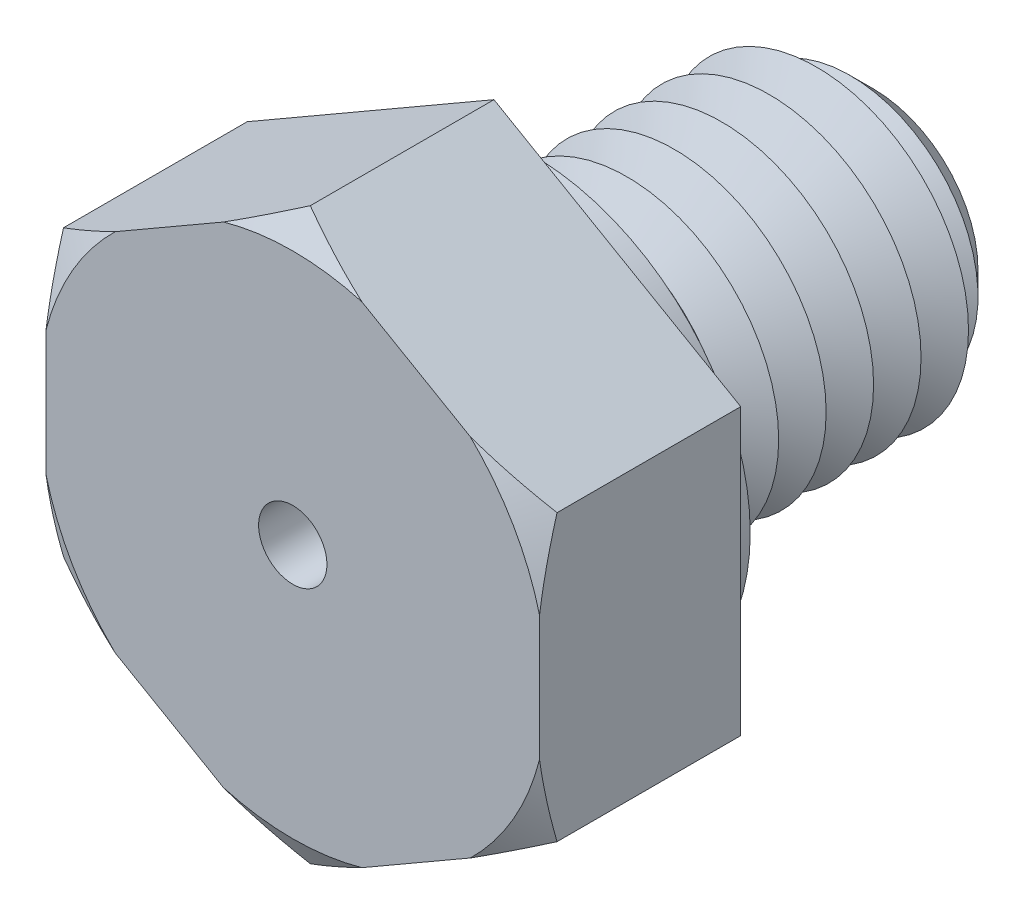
ISO-10303-21;
HEADER;
FILE_DESCRIPTION(('STEP AP214'),'2;1');
FILE_NAME('part.step','',(''),(''),'','','');
FILE_SCHEMA(('AUTOMOTIVE_DESIGN { 1 0 10303 214 1 1 1 1 }'));
ENDSEC;
DATA;
#1=APPLICATION_CONTEXT('core data for automotive mechanical design processes');
#2=APPLICATION_PROTOCOL_DEFINITION('international standard','automotive_design',2000,#1);
#3=PRODUCT_CONTEXT('',#1,'mechanical');
#4=PRODUCT('Part','Part','',(#3));
#5=PRODUCT_RELATED_PRODUCT_CATEGORY('part','',(#4));
#6=PRODUCT_DEFINITION_FORMATION('','',#4);
#7=PRODUCT_DEFINITION_CONTEXT('part definition',#1,'design');
#8=PRODUCT_DEFINITION('design','',#6,#7);
#9=PRODUCT_DEFINITION_SHAPE('','',#8);
#10=(LENGTH_UNIT() NAMED_UNIT(*) SI_UNIT(.MILLI.,.METRE.));
#11=(NAMED_UNIT(*) PLANE_ANGLE_UNIT() SI_UNIT($,.RADIAN.));
#12=(NAMED_UNIT(*) SI_UNIT($,.STERADIAN.) SOLID_ANGLE_UNIT());
#13=UNCERTAINTY_MEASURE_WITH_UNIT(LENGTH_MEASURE(1.E-05),#10,'distance_accuracy_value','');
#14=(GEOMETRIC_REPRESENTATION_CONTEXT(3) GLOBAL_UNCERTAINTY_ASSIGNED_CONTEXT((#13)) GLOBAL_UNIT_ASSIGNED_CONTEXT((#10,
#11,#12)) REPRESENTATION_CONTEXT('',''));
#15=CARTESIAN_POINT('',(0.,0.,0.));
#16=DIRECTION('',(0.,0.,1.));
#17=DIRECTION('',(1.,0.,0.));
#18=AXIS2_PLACEMENT_3D('',#15,#16,#17);
#19=CARTESIAN_POINT('',(6.5,3.75277674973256,5.3));
#20=DIRECTION('',(-0.5,-0.866025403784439,0.));
#21=DIRECTION('',(0.866025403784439,-0.5,0.));
#22=AXIS2_PLACEMENT_3D('',#19,#20,#21);
#23=PLANE('',#22);
#24=CARTESIAN_POINT('',(11.0120510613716,1.14774285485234,2.77920306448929));
#25=CARTESIAN_POINT('',(10.8078344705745,1.26564735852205,2.88939185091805));
#26=CARTESIAN_POINT('',(10.6031290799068,1.38383407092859,2.99839128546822));
#27=CARTESIAN_POINT('',(10.1925345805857,1.6208909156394,3.21345290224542));
#28=CARTESIAN_POINT('',(9.98664532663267,1.73976113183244,3.31951471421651));
#29=CARTESIAN_POINT('',(9.57286478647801,1.97865743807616,3.52844955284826));
#30=CARTESIAN_POINT('',(9.36496919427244,2.09868601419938,3.63131124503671));
#31=CARTESIAN_POINT('',(8.9476201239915,2.33964261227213,3.83272114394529));
#32=CARTESIAN_POINT('',(8.73816669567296,2.46057060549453,3.93126948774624));
#33=CARTESIAN_POINT('',(8.31210847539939,2.70655543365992,4.12554493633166));
#34=CARTESIAN_POINT('',(8.0954571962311,2.83163910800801,4.22113674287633));
#35=CARTESIAN_POINT('',(7.65996896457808,3.0830683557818,4.40550790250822));
#36=CARTESIAN_POINT('',(7.44113190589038,3.2094139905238,4.49428692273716));
#37=CARTESIAN_POINT('',(7.00122142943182,3.46339642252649,4.66334180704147));
#38=CARTESIAN_POINT('',(6.78015039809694,3.59103184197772,4.74362587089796));
#39=CARTESIAN_POINT('',(6.3354128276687,3.8478011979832,4.89383693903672));
#40=CARTESIAN_POINT('',(6.11174662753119,3.97693493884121,4.96376527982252));
#41=CARTESIAN_POINT('',(5.57683009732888,4.2857691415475,5.11501441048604));
#42=CARTESIAN_POINT('',(5.26433342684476,4.46618917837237,5.19069976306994));
#43=CARTESIAN_POINT('',(4.79238520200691,4.73866861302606,5.28165255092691));
#44=CARTESIAN_POINT('',(4.63453792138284,4.82980178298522,5.30820735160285));
#45=CARTESIAN_POINT('',(4.31797843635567,5.01256748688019,5.35312391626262));
#46=CARTESIAN_POINT('',(4.15926635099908,5.10419995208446,5.37148678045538));
#47=CARTESIAN_POINT('',(3.84309853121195,5.28673952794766,5.3993333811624));
#48=CARTESIAN_POINT('',(3.68564943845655,5.37764280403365,5.40891715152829));
#49=CARTESIAN_POINT('',(3.37053331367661,5.55957518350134,5.41928234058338));
#50=CARTESIAN_POINT('',(3.21286628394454,5.65060428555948,5.42006385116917));
#51=CARTESIAN_POINT('',(2.89768626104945,5.83257355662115,5.4127996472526));
#52=CARTESIAN_POINT('',(2.74017326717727,5.92351372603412,5.40475397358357));
#53=CARTESIAN_POINT('',(2.42563627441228,6.10511174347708,5.38007889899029));
#54=CARTESIAN_POINT('',(2.26861235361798,6.19576954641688,5.36344819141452));
#55=CARTESIAN_POINT('',(1.8976455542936,6.40994732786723,5.31443879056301));
#56=CARTESIAN_POINT('',(1.6840512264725,6.53326607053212,5.27851525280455));
#57=CARTESIAN_POINT('',(1.25890710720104,6.77872314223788,5.19313397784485));
#58=CARTESIAN_POINT('',(1.04735761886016,6.90086129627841,5.14367426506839));
#59=CARTESIAN_POINT('',(0.626329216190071,7.14394215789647,5.03308780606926));
#60=CARTESIAN_POINT('',(0.416852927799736,7.26488334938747,4.97194786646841));
#61=CARTESIAN_POINT('',(0.000251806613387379,7.50540811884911,4.83992704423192));
#62=CARTESIAN_POINT('',(-0.206873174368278,7.62499178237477,4.76904677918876));
#63=CARTESIAN_POINT('',(-0.621367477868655,7.86430018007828,4.61833709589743));
#64=CARTESIAN_POINT('',(-0.828710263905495,7.98400959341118,4.53841104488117));
#65=CARTESIAN_POINT('',(-1.2411992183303,8.22216020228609,4.3718486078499));
#66=CARTESIAN_POINT('',(-1.44634674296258,8.34060218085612,4.2852166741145));
#67=CARTESIAN_POINT('',(-1.85477207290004,8.57640665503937,4.10643213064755));
#68=CARTESIAN_POINT('',(-2.05805026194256,8.69376937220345,4.01428068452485));
#69=CARTESIAN_POINT('',(-2.46301289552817,8.92757465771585,3.82542322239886));
#70=CARTESIAN_POINT('',(-2.66469731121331,9.04401720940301,3.72871712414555));
#71=CARTESIAN_POINT('',(-3.00477721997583,9.24036243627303,3.56190249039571));
#72=CARTESIAN_POINT('',(-3.14353507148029,9.32047431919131,3.49277477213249));
#73=CARTESIAN_POINT('',(-3.42044427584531,9.48034792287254,3.35293264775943));
#74=CARTESIAN_POINT('',(-3.55859564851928,9.56010965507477,3.28221829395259));
#75=CARTESIAN_POINT('',(-3.83290330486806,9.71848125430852,3.14014092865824));
#76=CARTESIAN_POINT('',(-3.96906528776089,9.79709441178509,3.06879256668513));
#77=CARTESIAN_POINT('',(-4.24090766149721,9.9540426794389,2.92487520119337));
#78=CARTESIAN_POINT('',(-4.37658804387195,10.0323777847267,2.85230617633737));
#79=CARTESIAN_POINT('',(-4.5120510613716,10.1105873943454,2.77920306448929));
#80=B_SPLINE_CURVE_WITH_KNOTS('',3,(#24,#25,#26,#27,#28,#29,#30,#31,#32,#33,#34,#35,#36,#37,#38,
#39,#40,#41,#42,#43,#44,#45,#46,#47,#48,#49,#50,#51,#52,#53,#54,#55,#56,#57,#58,#59,#60,#61,#62,
#63,#64,#65,#66,#67,#68,#69,#70,#71,#72,#73,#74,#75,#76,#77,#78,#79),.UNSPECIFIED.,.F.,.F.,(4,2,
2,2,2,2,2,2,2,2,2,2,2,2,2,2,2,2,2,2,2,2,2,2,2,2,2,4),(0.,0.780858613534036,1.56181520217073,
2.34527979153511,3.12871946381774,3.93206444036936,4.73544864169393,5.53805016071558,
6.34054800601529,7.44542333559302,7.99784254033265,8.55018753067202,9.096157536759,
9.64212184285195,10.1880836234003,10.7341285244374,11.4813961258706,12.2287728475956,
12.9769988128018,13.7251773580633,14.4822772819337,15.2388787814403,15.9953213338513,
16.7517775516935,17.2752695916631,17.7987444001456,18.3167123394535,18.8346893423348),.UNSPECIFIED.);
#81=CARTESIAN_POINT('',(6.5,3.75277674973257,4.83811978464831));
#82=VERTEX_POINT('',#81);
#83=CARTESIAN_POINT('',(4.67682717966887,4.80538606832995,5.3));
#84=VERTEX_POINT('',#83);
#85=EDGE_CURVE('E132',#82,#84,#80,.T.);
#86=ORIENTED_EDGE('',*,*,#85,.F.);
#87=DIRECTION('',(0.,0.,-1.));
#88=VECTOR('',#87,1.);
#89=CARTESIAN_POINT('',(6.5,3.75277674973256,5.3));
#90=LINE('',#89,#88);
#91=CARTESIAN_POINT('',(6.5,3.75277674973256,0.));
#92=VERTEX_POINT('',#91);
#93=EDGE_CURVE('E144',#82,#92,#90,.T.);
#94=ORIENTED_EDGE('',*,*,#93,.T.);
#95=DIRECTION('',(-0.866025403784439,0.5,0.));
#96=VECTOR('',#95,1.);
#97=CARTESIAN_POINT('',(6.5,3.75277674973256,0.));
#98=LINE('',#97,#96);
#99=CARTESIAN_POINT('',(0.,7.50555349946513,0.));
#100=VERTEX_POINT('',#99);
#101=EDGE_CURVE('E261',#92,#100,#98,.T.);
#102=ORIENTED_EDGE('',*,*,#101,.T.);
#103=DIRECTION('',(0.,0.,-1.));
#104=VECTOR('',#103,1.);
#105=CARTESIAN_POINT('',(0.,7.50555349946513,5.3));
#106=LINE('',#105,#104);
#107=CARTESIAN_POINT('',(0.,7.50555349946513,4.83811978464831));
#108=VERTEX_POINT('',#107);
#109=EDGE_CURVE('E179',#108,#100,#106,.T.);
#110=ORIENTED_EDGE('',*,*,#109,.F.);
#111=CARTESIAN_POINT('',(1.82317282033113,6.45294418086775,5.3));
#112=VERTEX_POINT('',#111);
#113=EDGE_CURVE('E151',#112,#108,#80,.T.);
#114=ORIENTED_EDGE('',*,*,#113,.F.);
#115=DIRECTION('',(-0.866025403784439,0.5,0.));
#116=VECTOR('',#115,1.);
#117=CARTESIAN_POINT('',(6.5,3.75277674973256,5.3));
#118=LINE('',#117,#116);
#119=EDGE_CURVE('E148',#84,#112,#118,.T.);
#120=ORIENTED_EDGE('',*,*,#119,.F.);
#121=EDGE_LOOP('',(#86,#94,#102,#110,#114,#120));
#122=FACE_BOUND('',#121,.T.);
#123=ADVANCED_FACE('F39',(#122),#23,.F.);
#124=CARTESIAN_POINT('',(0.,7.50555349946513,5.3));
#125=DIRECTION('',(0.5,-0.866025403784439,0.));
#126=DIRECTION('',(0.866025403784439,0.5,0.));
#127=AXIS2_PLACEMENT_3D('',#124,#125,#126);
#128=PLANE('',#127);
#129=CARTESIAN_POINT('',(4.5120510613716,10.1105873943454,2.77920306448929));
#130=CARTESIAN_POINT('',(4.30783447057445,9.99268289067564,2.88939185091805));
#131=CARTESIAN_POINT('',(4.1031290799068,9.87449617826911,2.99839128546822));
#132=CARTESIAN_POINT('',(3.69253458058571,9.63743933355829,3.21345290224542));
#133=CARTESIAN_POINT('',(3.48664532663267,9.51856911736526,3.31951471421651));
#134=CARTESIAN_POINT('',(3.07286478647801,9.27967281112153,3.52844955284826));
#135=CARTESIAN_POINT('',(2.86496919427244,9.15964423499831,3.63131124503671));
#136=CARTESIAN_POINT('',(2.4476201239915,8.91868763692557,3.83272114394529));
#137=CARTESIAN_POINT('',(2.23816669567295,8.79775964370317,3.93126948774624));
#138=CARTESIAN_POINT('',(1.81210847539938,8.55177481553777,4.12554493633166));
#139=CARTESIAN_POINT('',(1.5954571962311,8.42669114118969,4.22113674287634));
#140=CARTESIAN_POINT('',(1.15996896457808,8.1752618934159,4.40550790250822));
#141=CARTESIAN_POINT('',(0.941131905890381,8.04891625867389,4.49428692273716));
#142=CARTESIAN_POINT('',(0.501221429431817,7.7949338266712,4.66334180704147));
#143=CARTESIAN_POINT('',(0.280150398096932,7.66729840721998,4.74362587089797));
#144=CARTESIAN_POINT('',(-0.164587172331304,7.4105290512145,4.89383693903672));
#145=CARTESIAN_POINT('',(-0.388253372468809,7.28139531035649,4.96376527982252));
#146=CARTESIAN_POINT('',(-0.923169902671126,6.9725611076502,5.11501441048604));
#147=CARTESIAN_POINT('',(-1.23566657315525,6.79214107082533,5.19069976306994));
#148=CARTESIAN_POINT('',(-1.70761479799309,6.51966163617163,5.28165255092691));
#149=CARTESIAN_POINT('',(-1.86546207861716,6.42852846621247,5.30820735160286));
#150=CARTESIAN_POINT('',(-2.18202156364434,6.24576276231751,5.35312391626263));
#151=CARTESIAN_POINT('',(-2.34073364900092,6.15413029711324,5.37148678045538));
#152=CARTESIAN_POINT('',(-2.65690146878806,5.97159072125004,5.3993333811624));
#153=CARTESIAN_POINT('',(-2.81435056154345,5.88068744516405,5.40891715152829));
#154=CARTESIAN_POINT('',(-3.12946668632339,5.69875506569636,5.41928234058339));
#155=CARTESIAN_POINT('',(-3.28713371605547,5.60772596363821,5.42006385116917));
#156=CARTESIAN_POINT('',(-3.60231373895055,5.42575669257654,5.4127996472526));
#157=CARTESIAN_POINT('',(-3.75982673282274,5.33481652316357,5.40475397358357));
#158=CARTESIAN_POINT('',(-4.07436372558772,5.15321850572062,5.38007889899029));
#159=CARTESIAN_POINT('',(-4.23138764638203,5.06256070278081,5.36344819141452));
#160=CARTESIAN_POINT('',(-4.60235444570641,4.84838292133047,5.31443879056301));
#161=CARTESIAN_POINT('',(-4.81594877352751,4.72506417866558,5.27851525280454));
#162=CARTESIAN_POINT('',(-5.24109289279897,4.47960710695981,5.19313397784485));
#163=CARTESIAN_POINT('',(-5.45264238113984,4.35746895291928,5.14367426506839));
#164=CARTESIAN_POINT('',(-5.87367078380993,4.11438809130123,5.03308780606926));
#165=CARTESIAN_POINT('',(-6.08314707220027,3.99344689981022,4.97194786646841));
#166=CARTESIAN_POINT('',(-6.49974819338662,3.75292213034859,4.83992704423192));
#167=CARTESIAN_POINT('',(-6.70687317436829,3.63333846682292,4.76904677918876));
#168=CARTESIAN_POINT('',(-7.12136747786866,3.39403006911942,4.61833709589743));
#169=CARTESIAN_POINT('',(-7.3287102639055,3.27432065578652,4.53841104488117));
#170=CARTESIAN_POINT('',(-7.74119921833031,3.03617004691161,4.3718486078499));
#171=CARTESIAN_POINT('',(-7.94634674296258,2.91772806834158,4.2852166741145));
#172=CARTESIAN_POINT('',(-8.35477207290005,2.68192359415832,4.10643213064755));
#173=CARTESIAN_POINT('',(-8.55805026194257,2.56456087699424,4.01428068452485));
#174=CARTESIAN_POINT('',(-8.96301289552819,2.33075559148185,3.82542322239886));
#175=CARTESIAN_POINT('',(-9.16469731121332,2.21431303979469,3.72871712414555));
#176=CARTESIAN_POINT('',(-9.50477721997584,2.01796781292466,3.5619024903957));
#177=CARTESIAN_POINT('',(-9.6435350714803,1.93785593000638,3.49277477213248));
#178=CARTESIAN_POINT('',(-9.92044427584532,1.77798232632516,3.35293264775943));
#179=CARTESIAN_POINT('',(-10.0585956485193,1.69822059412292,3.28221829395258));
#180=CARTESIAN_POINT('',(-10.3329033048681,1.53984899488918,3.14014092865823));
#181=CARTESIAN_POINT('',(-10.4690652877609,1.46123583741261,3.06879256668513));
#182=CARTESIAN_POINT('',(-10.7409076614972,1.3042875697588,2.92487520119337));
#183=CARTESIAN_POINT('',(-10.876588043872,1.225952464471,2.85230617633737));
#184=CARTESIAN_POINT('',(-11.0120510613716,1.14774285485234,2.77920306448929));
#185=B_SPLINE_CURVE_WITH_KNOTS('',3,(#129,#130,#131,#132,#133,#134,#135,#136,#137,#138,#139,
#140,#141,#142,#143,#144,#145,#146,#147,#148,#149,#150,#151,#152,#153,#154,#155,#156,#157,#158,
#159,#160,#161,#162,#163,#164,#165,#166,#167,#168,#169,#170,#171,#172,#173,#174,#175,#176,#177,
#178,#179,#180,#181,#182,#183,#184),.UNSPECIFIED.,.F.,.F.,(4,2,2,2,2,2,2,2,2,2,2,2,2,2,2,2,2,2,
2,2,2,2,2,2,2,2,2,4),(0.,0.780858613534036,1.56181520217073,2.34527979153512,3.12871946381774,
3.93206444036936,4.73544864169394,5.53805016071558,6.34054800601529,7.44542333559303,
7.99784254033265,8.55018753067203,9.096157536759,9.64212184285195,10.1880836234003,
10.7341285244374,11.4813961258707,12.2287728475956,12.9769988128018,13.7251773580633,
14.4822772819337,15.2388787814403,15.9953213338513,16.7517775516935,17.2752695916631,
17.7987444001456,18.3167123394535,18.8346893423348),.UNSPECIFIED.);
#186=CARTESIAN_POINT('',(-1.82317282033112,6.45294418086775,5.3));
#187=VERTEX_POINT('',#186);
#188=EDGE_CURVE('E712',#108,#187,#185,.T.);
#189=ORIENTED_EDGE('',*,*,#188,.F.);
#190=ORIENTED_EDGE('',*,*,#109,.T.);
#191=DIRECTION('',(-0.866025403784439,-0.5,0.));
#192=VECTOR('',#191,1.);
#193=CARTESIAN_POINT('',(0.,7.50555349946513,0.));
#194=LINE('',#193,#192);
#195=CARTESIAN_POINT('',(-6.5,3.75277674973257,0.));
#196=VERTEX_POINT('',#195);
#197=EDGE_CURVE('E281',#100,#196,#194,.T.);
#198=ORIENTED_EDGE('',*,*,#197,.T.);
#199=DIRECTION('',(0.,0.,-1.));
#200=VECTOR('',#199,1.);
#201=CARTESIAN_POINT('',(-6.5,3.75277674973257,5.3));
#202=LINE('',#201,#200);
#203=CARTESIAN_POINT('',(-6.5,3.75277674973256,4.83811978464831));
#204=VERTEX_POINT('',#203);
#205=EDGE_CURVE('E176',#204,#196,#202,.T.);
#206=ORIENTED_EDGE('',*,*,#205,.F.);
#207=CARTESIAN_POINT('',(-4.67682717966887,4.80538606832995,5.3));
#208=VERTEX_POINT('',#207);
#209=EDGE_CURVE('E362',#208,#204,#185,.T.);
#210=ORIENTED_EDGE('',*,*,#209,.F.);
#211=DIRECTION('',(-0.866025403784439,-0.5,0.));
#212=VECTOR('',#211,1.);
#213=CARTESIAN_POINT('',(0.,7.50555349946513,5.3));
#214=LINE('',#213,#212);
#215=EDGE_CURVE('E264',#187,#208,#214,.T.);
#216=ORIENTED_EDGE('',*,*,#215,.F.);
#217=EDGE_LOOP('',(#189,#190,#198,#206,#210,#216));
#218=FACE_BOUND('',#217,.T.);
#219=ADVANCED_FACE('F371',(#218),#128,.F.);
#220=CARTESIAN_POINT('',(-6.5,3.75277674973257,5.3));
#221=DIRECTION('',(1.,0.,0.));
#222=DIRECTION('',(0.,0.,-1.));
#223=AXIS2_PLACEMENT_3D('',#220,#221,#222);
#224=PLANE('',#223);
#225=CARTESIAN_POINT('',(-6.5,8.26482781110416,3.10083044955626));
#226=CARTESIAN_POINT('',(-6.5,8.03000458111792,3.20736842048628));
#227=CARTESIAN_POINT('',(-6.5,7.79453887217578,3.31251727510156));
#228=CARTESIAN_POINT('',(-6.5,7.32204728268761,3.51936269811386));
#229=CARTESIAN_POINT('',(-6.5,7.08502112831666,3.62105864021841));
#230=CARTESIAN_POINT('',(-6.5,6.6082238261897,3.82070151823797));
#231=CARTESIAN_POINT('',(-6.5,6.36844534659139,3.91863101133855));
#232=CARTESIAN_POINT('',(-6.5,5.88686103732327,4.10935828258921));
#233=CARTESIAN_POINT('',(-6.5,5.64505530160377,4.20215629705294));
#234=CARTESIAN_POINT('',(-6.5,5.16020806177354,4.38107583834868));
#235=CARTESIAN_POINT('',(-6.5,4.91717698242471,4.46722547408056));
#236=CARTESIAN_POINT('',(-6.5,4.42851680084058,4.63190822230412));
#237=CARTESIAN_POINT('',(-6.5,4.18288757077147,4.71044095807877));
#238=CARTESIAN_POINT('',(-6.5,3.68915983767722,4.85808723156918));
#239=CARTESIAN_POINT('',(-6.5,3.44106517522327,4.9272135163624));
#240=CARTESIAN_POINT('',(-6.5,2.94198131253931,5.05420795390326));
#241=CARTESIAN_POINT('',(-6.5,2.69099223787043,5.1120765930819));
#242=CARTESIAN_POINT('',(-6.5,2.25769005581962,5.19995201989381));
#243=CARTESIAN_POINT('',(-6.5,2.07603591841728,5.23320954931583));
#244=CARTESIAN_POINT('',(-6.5,1.71151122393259,5.29207741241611));
#245=CARTESIAN_POINT('',(-6.5,1.52864087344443,5.31768901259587));
#246=CARTESIAN_POINT('',(-6.5,1.16195360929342,5.36059506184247));
#247=CARTESIAN_POINT('',(-6.5,0.978136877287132,5.37789105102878));
#248=CARTESIAN_POINT('',(-6.5,0.609880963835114,5.40367049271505));
#249=CARTESIAN_POINT('',(-6.5,0.425441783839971,5.41215396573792));
#250=CARTESIAN_POINT('',(-6.5,0.0564612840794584,5.42004368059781));
#251=CARTESIAN_POINT('',(-6.5,-0.128079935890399,5.41945454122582));
#252=CARTESIAN_POINT('',(-6.5,-0.49690745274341,5.40922941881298));
#253=CARTESIAN_POINT('',(-6.5,-0.681193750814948,5.39959347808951));
#254=CARTESIAN_POINT('',(-6.5,-1.04910266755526,5.37156866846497));
#255=CARTESIAN_POINT('',(-6.5,-1.23272526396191,5.35317950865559));
#256=CARTESIAN_POINT('',(-6.5,-1.5989735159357,5.30817918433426));
#257=CARTESIAN_POINT('',(-6.5,-1.78159898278,5.28156651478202));
#258=CARTESIAN_POINT('',(-6.5,-2.5090476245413,5.16009602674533));
#259=CARTESIAN_POINT('',(-6.5,-3.04897729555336,5.0350728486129));
#260=CARTESIAN_POINT('',(-6.5,-3.8489021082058,4.8122065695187));
#261=CARTESIAN_POINT('',(-6.5,-4.11422810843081,4.73189887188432));
#262=CARTESIAN_POINT('',(-6.5,-4.64182213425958,4.5617271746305));
#263=CARTESIAN_POINT('',(-6.5,-4.90409037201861,4.47186384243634));
#264=CARTESIAN_POINT('',(-6.5,-5.42881258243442,4.28339622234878));
#265=CARTESIAN_POINT('',(-6.5,-5.69123450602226,4.18470387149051));
#266=CARTESIAN_POINT('',(-6.5,-6.21363007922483,3.98100889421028));
#267=CARTESIAN_POINT('',(-6.5,-6.4736035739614,3.87600587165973));
#268=CARTESIAN_POINT('',(-6.5,-6.98982707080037,3.66159357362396));
#269=CARTESIAN_POINT('',(-6.5,-7.24609016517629,3.55221565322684));
#270=CARTESIAN_POINT('',(-6.5,-7.75676014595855,3.32937132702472));
#271=CARTESIAN_POINT('',(-6.5,-8.0111674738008,3.21590593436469));
#272=CARTESIAN_POINT('',(-6.5,-8.26482781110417,3.10083044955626));
#273=B_SPLINE_CURVE_WITH_KNOTS('',3,(#225,#226,#227,#228,#229,#230,#231,#232,#233,#234,#235,
#236,#237,#238,#239,#240,#241,#242,#243,#244,#245,#246,#247,#248,#249,#250,#251,#252,#253,#254,
#255,#256,#257,#258,#259,#260,#261,#262,#263,#264,#265,#266,#267,#268,#269,#270,#271,#272),
.UNSPECIFIED.,.F.,.F.,(4,2,2,2,2,2,2,2,2,2,2,2,2,2,2,2,2,2,2,2,2,2,2,4),(0.,0.773595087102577,
1.54732974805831,2.3242977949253,3.10123003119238,3.87467353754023,4.64815527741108,
5.42057817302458,6.19296768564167,6.74684672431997,7.30063396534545,7.85431860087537,
8.40800194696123,8.96140342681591,9.51480231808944,10.0682196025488,10.621738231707,
12.2804682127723,13.1120468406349,13.9435674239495,14.7845791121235,15.625643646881,
16.4614935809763,17.2971377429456),.UNSPECIFIED.);
#274=CARTESIAN_POINT('',(-6.5,1.64755811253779,5.3));
#275=VERTEX_POINT('',#274);
#276=EDGE_CURVE('E360',#204,#275,#273,.T.);
#277=ORIENTED_EDGE('',*,*,#276,.F.);
#278=ORIENTED_EDGE('',*,*,#205,.T.);
#279=DIRECTION('',(0.,-1.,0.));
#280=VECTOR('',#279,1.);
#281=CARTESIAN_POINT('',(-6.5,3.75277674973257,0.));
#282=LINE('',#281,#280);
#283=CARTESIAN_POINT('',(-6.5,-3.75277674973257,0.));
#284=VERTEX_POINT('',#283);
#285=EDGE_CURVE('E285',#196,#284,#282,.T.);
#286=ORIENTED_EDGE('',*,*,#285,.T.);
#287=DIRECTION('',(0.,0.,-1.));
#288=VECTOR('',#287,1.);
#289=CARTESIAN_POINT('',(-6.5,-3.75277674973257,5.3));
#290=LINE('',#289,#288);
#291=CARTESIAN_POINT('',(-6.49999999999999,-3.75277674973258,4.83811978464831));
#292=VERTEX_POINT('',#291);
#293=EDGE_CURVE('E173',#292,#284,#290,.T.);
#294=ORIENTED_EDGE('',*,*,#293,.F.);
#295=CARTESIAN_POINT('',(-6.5,-1.64755811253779,5.3));
#296=VERTEX_POINT('',#295);
#297=EDGE_CURVE('E354',#296,#292,#273,.T.);
#298=ORIENTED_EDGE('',*,*,#297,.F.);
#299=DIRECTION('',(0.,-1.,0.));
#300=VECTOR('',#299,1.);
#301=CARTESIAN_POINT('',(-6.5,3.75277674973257,5.3));
#302=LINE('',#301,#300);
#303=EDGE_CURVE('E268',#275,#296,#302,.T.);
#304=ORIENTED_EDGE('',*,*,#303,.F.);
#305=EDGE_LOOP('',(#277,#278,#286,#294,#298,#304));
#306=FACE_BOUND('',#305,.T.);
#307=ADVANCED_FACE('F367',(#306),#224,.F.);
#308=CARTESIAN_POINT('',(-6.5,-3.75277674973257,5.3));
#309=DIRECTION('',(0.5,0.866025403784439,0.));
#310=DIRECTION('',(-0.866025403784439,0.5,0.));
#311=AXIS2_PLACEMENT_3D('',#308,#309,#310);
#312=PLANE('',#311);
#313=CARTESIAN_POINT('',(-11.0120510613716,-1.14774285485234,2.77920306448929));
#314=CARTESIAN_POINT('',(-10.8078344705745,-1.26564735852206,2.88939185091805));
#315=CARTESIAN_POINT('',(-10.6031290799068,-1.3838340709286,2.99839128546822));
#316=CARTESIAN_POINT('',(-10.1925345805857,-1.62089091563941,3.21345290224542));
#317=CARTESIAN_POINT('',(-9.98664532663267,-1.73976113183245,3.31951471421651));
#318=CARTESIAN_POINT('',(-9.572864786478,-1.97865743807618,3.52844955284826));
#319=CARTESIAN_POINT('',(-9.36496919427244,-2.09868601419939,3.63131124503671));
#320=CARTESIAN_POINT('',(-8.94762012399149,-2.33964261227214,3.83272114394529));
#321=CARTESIAN_POINT('',(-8.73816669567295,-2.46057060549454,3.93126948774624));
#322=CARTESIAN_POINT('',(-8.31210847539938,-2.70655543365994,4.12554493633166));
#323=CARTESIAN_POINT('',(-8.0954571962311,-2.83163910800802,4.22113674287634));
#324=CARTESIAN_POINT('',(-7.65996896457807,-3.08306835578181,4.40550790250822));
#325=CARTESIAN_POINT('',(-7.44113190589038,-3.20941399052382,4.49428692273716));
#326=CARTESIAN_POINT('',(-7.00122142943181,-3.46339642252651,4.66334180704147));
#327=CARTESIAN_POINT('',(-6.78015039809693,-3.59103184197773,4.74362587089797));
#328=CARTESIAN_POINT('',(-6.33541282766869,-3.84780119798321,4.89383693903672));
#329=CARTESIAN_POINT('',(-6.11174662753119,-3.97693493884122,4.96376527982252));
#330=CARTESIAN_POINT('',(-5.57683009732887,-4.28576914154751,5.11501441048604));
#331=CARTESIAN_POINT('',(-5.26433342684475,-4.46618917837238,5.19069976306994));
#332=CARTESIAN_POINT('',(-4.7923852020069,-4.73866861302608,5.28165255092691));
#333=CARTESIAN_POINT('',(-4.63453792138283,-4.82980178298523,5.30820735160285));
#334=CARTESIAN_POINT('',(-4.31797843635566,-5.0125674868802,5.35312391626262));
#335=CARTESIAN_POINT('',(-4.15926635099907,-5.10419995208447,5.37148678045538));
#336=CARTESIAN_POINT('',(-3.84309853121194,-5.28673952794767,5.39933338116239));
#337=CARTESIAN_POINT('',(-3.68564943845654,-5.37764280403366,5.40891715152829));
#338=CARTESIAN_POINT('',(-3.3705333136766,-5.55957518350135,5.41928234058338));
#339=CARTESIAN_POINT('',(-3.21286628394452,-5.6506042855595,5.42006385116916));
#340=CARTESIAN_POINT('',(-2.89768626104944,-5.83257355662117,5.41279964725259));
#341=CARTESIAN_POINT('',(-2.74017326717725,-5.92351372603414,5.40475397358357));
#342=CARTESIAN_POINT('',(-2.42563627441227,-6.1051117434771,5.38007889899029));
#343=CARTESIAN_POINT('',(-2.26861235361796,-6.1957695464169,5.36344819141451));
#344=CARTESIAN_POINT('',(-1.89764555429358,-6.40994732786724,5.314438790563));
#345=CARTESIAN_POINT('',(-1.68405122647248,-6.53326607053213,5.27851525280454));
#346=CARTESIAN_POINT('',(-1.25890710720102,-6.7787231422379,5.19313397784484));
#347=CARTESIAN_POINT('',(-1.04735761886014,-6.90086129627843,5.14367426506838));
#348=CARTESIAN_POINT('',(-0.626329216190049,-7.14394215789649,5.03308780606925));
#349=CARTESIAN_POINT('',(-0.416852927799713,-7.26488334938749,4.9719478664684));
#350=CARTESIAN_POINT('',(-0.000251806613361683,-7.50540811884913,4.83992704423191));
#351=CARTESIAN_POINT('',(0.206873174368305,-7.62499178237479,4.76904677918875));
#352=CARTESIAN_POINT('',(0.621367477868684,-7.8643001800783,4.61833709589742));
#353=CARTESIAN_POINT('',(0.828710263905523,-7.9840095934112,4.53841104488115));
#354=CARTESIAN_POINT('',(1.24119921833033,-8.22216020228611,4.37184860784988));
#355=CARTESIAN_POINT('',(1.44634674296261,-8.34060218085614,4.28521667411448));
#356=CARTESIAN_POINT('',(1.85477207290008,-8.5764066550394,4.10643213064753));
#357=CARTESIAN_POINT('',(2.0580502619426,-8.69376937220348,4.01428068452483));
#358=CARTESIAN_POINT('',(2.46301289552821,-8.92757465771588,3.82542322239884));
#359=CARTESIAN_POINT('',(2.66469731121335,-9.04401720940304,3.72871712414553));
#360=CARTESIAN_POINT('',(3.00477721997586,-9.24036243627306,3.56190249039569));
#361=CARTESIAN_POINT('',(3.14353507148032,-9.32047431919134,3.49277477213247));
#362=CARTESIAN_POINT('',(3.42044427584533,-9.48034792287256,3.35293264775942));
#363=CARTESIAN_POINT('',(3.55859564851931,-9.56010965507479,3.28221829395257));
#364=CARTESIAN_POINT('',(3.83290330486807,-9.71848125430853,3.14014092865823));
#365=CARTESIAN_POINT('',(3.9690652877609,-9.7970944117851,3.06879256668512));
#366=CARTESIAN_POINT('',(4.24090766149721,-9.9540426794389,2.92487520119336));
#367=CARTESIAN_POINT('',(4.37658804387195,-10.0323777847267,2.85230617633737));
#368=CARTESIAN_POINT('',(4.51205106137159,-10.1105873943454,2.77920306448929));
#369=B_SPLINE_CURVE_WITH_KNOTS('',3,(#313,#314,#315,#316,#317,#318,#319,#320,#321,#322,#323,
#324,#325,#326,#327,#328,#329,#330,#331,#332,#333,#334,#335,#336,#337,#338,#339,#340,#341,#342,
#343,#344,#345,#346,#347,#348,#349,#350,#351,#352,#353,#354,#355,#356,#357,#358,#359,#360,#361,
#362,#363,#364,#365,#366,#367,#368),.UNSPECIFIED.,.F.,.F.,(4,2,2,2,2,2,2,2,2,2,2,2,2,2,2,2,2,2,
2,2,2,2,2,2,2,2,2,4),(0.,0.780858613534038,1.56181520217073,2.34527979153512,3.12871946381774,
3.93206444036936,4.73544864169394,5.53805016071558,6.3405480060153,7.44542333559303,
7.99784254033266,8.55018753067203,9.09615753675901,9.64212184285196,10.1880836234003,
10.7341285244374,11.4813961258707,12.2287728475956,12.9769988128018,13.7251773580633,
14.4822772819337,15.2388787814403,15.9953213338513,16.7517775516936,17.2752695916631,
17.7987444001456,18.3167123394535,18.8346893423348),.UNSPECIFIED.);
#370=CARTESIAN_POINT('',(-4.67682717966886,-4.80538606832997,5.3));
#371=VERTEX_POINT('',#370);
#372=EDGE_CURVE('E361',#292,#371,#369,.T.);
#373=ORIENTED_EDGE('',*,*,#372,.F.);
#374=ORIENTED_EDGE('',*,*,#293,.T.);
#375=DIRECTION('',(0.866025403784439,-0.5,0.));
#376=VECTOR('',#375,1.);
#377=CARTESIAN_POINT('',(-6.5,-3.75277674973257,0.));
#378=LINE('',#377,#376);
#379=CARTESIAN_POINT('',(0.,-7.50555349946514,0.));
#380=VERTEX_POINT('',#379);
#381=EDGE_CURVE('E289',#284,#380,#378,.T.);
#382=ORIENTED_EDGE('',*,*,#381,.T.);
#383=DIRECTION('',(0.,0.,-1.));
#384=VECTOR('',#383,1.);
#385=CARTESIAN_POINT('',(0.,-7.50555349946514,5.3));
#386=LINE('',#385,#384);
#387=CARTESIAN_POINT('',(0.,-7.50555349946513,4.83811978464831));
#388=VERTEX_POINT('',#387);
#389=EDGE_CURVE('E163',#388,#380,#386,.T.);
#390=ORIENTED_EDGE('',*,*,#389,.F.);
#391=CARTESIAN_POINT('',(-1.82317282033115,-6.45294418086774,5.3));
#392=VERTEX_POINT('',#391);
#393=EDGE_CURVE('E318',#392,#388,#369,.T.);
#394=ORIENTED_EDGE('',*,*,#393,.F.);
#395=DIRECTION('',(0.866025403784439,-0.5,0.));
#396=VECTOR('',#395,1.);
#397=CARTESIAN_POINT('',(-6.5,-3.75277674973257,5.3));
#398=LINE('',#397,#396);
#399=EDGE_CURVE('E272',#371,#392,#398,.T.);
#400=ORIENTED_EDGE('',*,*,#399,.F.);
#401=EDGE_LOOP('',(#373,#374,#382,#390,#394,#400));
#402=FACE_BOUND('',#401,.T.);
#403=ADVANCED_FACE('F370',(#402),#312,.F.);
#404=CARTESIAN_POINT('',(0.,-7.50555349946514,5.3));
#405=DIRECTION('',(-0.5,0.866025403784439,0.));
#406=DIRECTION('',(-0.866025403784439,-0.5,0.));
#407=AXIS2_PLACEMENT_3D('',#404,#405,#406);
#408=PLANE('',#407);
#409=CARTESIAN_POINT('',(-4.5120510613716,-10.1105873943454,2.77920306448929));
#410=CARTESIAN_POINT('',(-4.30783447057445,-9.99268289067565,2.88939185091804));
#411=CARTESIAN_POINT('',(-4.1031290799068,-9.87449617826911,2.99839128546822));
#412=CARTESIAN_POINT('',(-3.69253458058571,-9.6374393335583,3.21345290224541));
#413=CARTESIAN_POINT('',(-3.48664532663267,-9.51856911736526,3.3195147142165));
#414=CARTESIAN_POINT('',(-3.072864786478,-9.27967281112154,3.52844955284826));
#415=CARTESIAN_POINT('',(-2.86496919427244,-9.15964423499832,3.6313112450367));
#416=CARTESIAN_POINT('',(-2.4476201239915,-8.91868763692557,3.83272114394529));
#417=CARTESIAN_POINT('',(-2.23816669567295,-8.79775964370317,3.93126948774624));
#418=CARTESIAN_POINT('',(-1.81210847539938,-8.55177481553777,4.12554493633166));
#419=CARTESIAN_POINT('',(-1.5954571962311,-8.42669114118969,4.22113674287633));
#420=CARTESIAN_POINT('',(-1.15996896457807,-8.1752618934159,4.40550790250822));
#421=CARTESIAN_POINT('',(-0.941131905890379,-8.04891625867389,4.49428692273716));
#422=CARTESIAN_POINT('',(-0.501221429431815,-7.79493382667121,4.66334180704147));
#423=CARTESIAN_POINT('',(-0.28015039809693,-7.66729840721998,4.74362587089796));
#424=CARTESIAN_POINT('',(0.164587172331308,-7.4105290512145,4.89383693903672));
#425=CARTESIAN_POINT('',(0.388253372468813,-7.28139531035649,4.96376527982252));
#426=CARTESIAN_POINT('',(0.92316990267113,-6.9725611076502,5.11501441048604));
#427=CARTESIAN_POINT('',(1.23566657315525,-6.79214107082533,5.19069976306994));
#428=CARTESIAN_POINT('',(1.7076147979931,-6.51966163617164,5.28165255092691));
#429=CARTESIAN_POINT('',(1.86546207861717,-6.42852846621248,5.30820735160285));
#430=CARTESIAN_POINT('',(2.18202156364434,-6.24576276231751,5.35312391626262));
#431=CARTESIAN_POINT('',(2.34073364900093,-6.15413029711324,5.37148678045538));
#432=CARTESIAN_POINT('',(2.65690146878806,-5.97159072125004,5.3993333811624));
#433=CARTESIAN_POINT('',(2.81435056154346,-5.88068744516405,5.40891715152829));
#434=CARTESIAN_POINT('',(3.1294666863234,-5.69875506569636,5.41928234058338));
#435=CARTESIAN_POINT('',(3.28713371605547,-5.60772596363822,5.42006385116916));
#436=CARTESIAN_POINT('',(3.60231373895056,-5.42575669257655,5.41279964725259));
#437=CARTESIAN_POINT('',(3.75982673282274,-5.33481652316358,5.40475397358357));
#438=CARTESIAN_POINT('',(4.07436372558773,-5.15321850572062,5.38007889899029));
#439=CARTESIAN_POINT('',(4.23138764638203,-5.06256070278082,5.36344819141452));
#440=CARTESIAN_POINT('',(4.60235444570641,-4.84838292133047,5.31443879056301));
#441=CARTESIAN_POINT('',(4.81594877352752,-4.72506417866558,5.27851525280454));
#442=CARTESIAN_POINT('',(5.24109289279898,-4.47960710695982,5.19313397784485));
#443=CARTESIAN_POINT('',(5.45264238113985,-4.35746895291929,5.14367426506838));
#444=CARTESIAN_POINT('',(5.87367078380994,-4.11438809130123,5.03308780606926));
#445=CARTESIAN_POINT('',(6.08314707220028,-3.99344689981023,4.9719478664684));
#446=CARTESIAN_POINT('',(6.49974819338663,-3.75292213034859,4.83992704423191));
#447=CARTESIAN_POINT('',(6.7068731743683,-3.63333846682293,4.76904677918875));
#448=CARTESIAN_POINT('',(7.12136747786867,-3.39403006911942,4.61833709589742));
#449=CARTESIAN_POINT('',(7.32871026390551,-3.27432065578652,4.53841104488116));
#450=CARTESIAN_POINT('',(7.74119921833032,-3.03617004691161,4.37184860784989));
#451=CARTESIAN_POINT('',(7.9463467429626,-2.91772806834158,4.28521667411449));
#452=CARTESIAN_POINT('',(8.35477207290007,-2.68192359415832,4.10643213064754));
#453=CARTESIAN_POINT('',(8.55805026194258,-2.56456087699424,4.01428068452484));
#454=CARTESIAN_POINT('',(8.9630128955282,-2.33075559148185,3.82542322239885));
#455=CARTESIAN_POINT('',(9.16469731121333,-2.21431303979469,3.72871712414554));
#456=CARTESIAN_POINT('',(9.50477721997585,-2.01796781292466,3.56190249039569));
#457=CARTESIAN_POINT('',(9.64353507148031,-1.93785593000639,3.49277477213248));
#458=CARTESIAN_POINT('',(9.92044427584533,-1.77798232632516,3.35293264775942));
#459=CARTESIAN_POINT('',(10.0585956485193,-1.69822059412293,3.28221829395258));
#460=CARTESIAN_POINT('',(10.3329033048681,-1.53984899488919,3.14014092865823));
#461=CARTESIAN_POINT('',(10.4690652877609,-1.46123583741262,3.06879256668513));
#462=CARTESIAN_POINT('',(10.7409076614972,-1.30428756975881,2.92487520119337));
#463=CARTESIAN_POINT('',(10.876588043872,-1.22595246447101,2.85230617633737));
#464=CARTESIAN_POINT('',(11.0120510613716,-1.14774285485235,2.77920306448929));
#465=B_SPLINE_CURVE_WITH_KNOTS('',3,(#409,#410,#411,#412,#413,#414,#415,#416,#417,#418,#419,
#420,#421,#422,#423,#424,#425,#426,#427,#428,#429,#430,#431,#432,#433,#434,#435,#436,#437,#438,
#439,#440,#441,#442,#443,#444,#445,#446,#447,#448,#449,#450,#451,#452,#453,#454,#455,#456,#457,
#458,#459,#460,#461,#462,#463,#464),.UNSPECIFIED.,.F.,.F.,(4,2,2,2,2,2,2,2,2,2,2,2,2,2,2,2,2,2,
2,2,2,2,2,2,2,2,2,4),(0.,0.780858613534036,1.56181520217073,2.34527979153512,3.12871946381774,
3.93206444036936,4.73544864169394,5.53805016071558,6.3405480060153,7.44542333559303,
7.99784254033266,8.55018753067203,9.09615753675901,9.64212184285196,10.1880836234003,
10.7341285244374,11.4813961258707,12.2287728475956,12.9769988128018,13.7251773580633,
14.4822772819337,15.2388787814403,15.9953213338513,16.7517775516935,17.2752695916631,
17.7987444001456,18.3167123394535,18.8346893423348),.UNSPECIFIED.);
#466=CARTESIAN_POINT('',(1.82317282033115,-6.45294418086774,5.3));
#467=VERTEX_POINT('',#466);
#468=EDGE_CURVE('E64',#388,#467,#465,.T.);
#469=ORIENTED_EDGE('',*,*,#468,.F.);
#470=ORIENTED_EDGE('',*,*,#389,.T.);
#471=DIRECTION('',(0.866025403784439,0.5,0.));
#472=VECTOR('',#471,1.);
#473=CARTESIAN_POINT('',(0.,-7.50555349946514,0.));
#474=LINE('',#473,#472);
#475=CARTESIAN_POINT('',(6.5,-3.75277674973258,0.));
#476=VERTEX_POINT('',#475);
#477=EDGE_CURVE('E292',#380,#476,#474,.T.);
#478=ORIENTED_EDGE('',*,*,#477,.T.);
#479=DIRECTION('',(0.,0.,-1.));
#480=VECTOR('',#479,1.);
#481=CARTESIAN_POINT('',(6.5,-3.75277674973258,5.3));
#482=LINE('',#481,#480);
#483=CARTESIAN_POINT('',(6.5,-3.75277674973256,4.83811978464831));
#484=VERTEX_POINT('',#483);
#485=EDGE_CURVE('E157',#484,#476,#482,.T.);
#486=ORIENTED_EDGE('',*,*,#485,.F.);
#487=CARTESIAN_POINT('',(4.67682717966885,-4.80538606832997,5.3));
#488=VERTEX_POINT('',#487);
#489=EDGE_CURVE('E315',#488,#484,#465,.T.);
#490=ORIENTED_EDGE('',*,*,#489,.F.);
#491=DIRECTION('',(0.866025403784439,0.5,0.));
#492=VECTOR('',#491,1.);
#493=CARTESIAN_POINT('',(0.,-7.50555349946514,5.3));
#494=LINE('',#493,#492);
#495=EDGE_CURVE('E166',#467,#488,#494,.T.);
#496=ORIENTED_EDGE('',*,*,#495,.F.);
#497=EDGE_LOOP('',(#469,#470,#478,#486,#490,#496));
#498=FACE_BOUND('',#497,.T.);
#499=ADVANCED_FACE('F316',(#498),#408,.F.);
#500=CARTESIAN_POINT('',(6.5,-3.75277674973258,5.3));
#501=DIRECTION('',(-1.,0.,0.));
#502=DIRECTION('',(0.,-1.,0.));
#503=AXIS2_PLACEMENT_3D('',#500,#501,#502);
#504=PLANE('',#503);
#505=CARTESIAN_POINT('',(6.5,-8.26482781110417,3.10083044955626));
#506=CARTESIAN_POINT('',(6.5,-8.03000458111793,3.20736842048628));
#507=CARTESIAN_POINT('',(6.5,-7.79453887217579,3.31251727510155));
#508=CARTESIAN_POINT('',(6.5,-7.32204728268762,3.51936269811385));
#509=CARTESIAN_POINT('',(6.5,-7.08502112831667,3.62105864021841));
#510=CARTESIAN_POINT('',(6.5,-6.60822382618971,3.82070151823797));
#511=CARTESIAN_POINT('',(6.5,-6.3684453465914,3.91863101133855));
#512=CARTESIAN_POINT('',(6.5,-5.88686103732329,4.10935828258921));
#513=CARTESIAN_POINT('',(6.5,-5.64505530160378,4.20215629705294));
#514=CARTESIAN_POINT('',(6.5,-5.16020806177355,4.38107583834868));
#515=CARTESIAN_POINT('',(6.5,-4.91717698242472,4.46722547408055));
#516=CARTESIAN_POINT('',(6.5,-4.42851680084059,4.63190822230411));
#517=CARTESIAN_POINT('',(6.5,-4.18288757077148,4.71044095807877));
#518=CARTESIAN_POINT('',(6.5,-3.68915983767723,4.85808723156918));
#519=CARTESIAN_POINT('',(6.5,-3.44106517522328,4.9272135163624));
#520=CARTESIAN_POINT('',(6.5,-2.94198131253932,5.05420795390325));
#521=CARTESIAN_POINT('',(6.5,-2.69099223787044,5.1120765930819));
#522=CARTESIAN_POINT('',(6.5,-2.25769005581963,5.19995201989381));
#523=CARTESIAN_POINT('',(6.5,-2.07603591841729,5.23320954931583));
#524=CARTESIAN_POINT('',(6.5,-1.7115112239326,5.29207741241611));
#525=CARTESIAN_POINT('',(6.5,-1.52864087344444,5.31768901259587));
#526=CARTESIAN_POINT('',(6.5,-1.16195360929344,5.36059506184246));
#527=CARTESIAN_POINT('',(6.5,-0.978136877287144,5.37789105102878));
#528=CARTESIAN_POINT('',(6.5,-0.609880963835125,5.40367049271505));
#529=CARTESIAN_POINT('',(6.5,-0.425441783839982,5.41215396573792));
#530=CARTESIAN_POINT('',(6.5,-0.056461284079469,5.42004368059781));
#531=CARTESIAN_POINT('',(6.5,0.128079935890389,5.41945454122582));
#532=CARTESIAN_POINT('',(6.5,0.496907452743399,5.40922941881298));
#533=CARTESIAN_POINT('',(6.5,0.681193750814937,5.39959347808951));
#534=CARTESIAN_POINT('',(6.5,1.04910266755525,5.37156866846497));
#535=CARTESIAN_POINT('',(6.5,1.2327252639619,5.35317950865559));
#536=CARTESIAN_POINT('',(6.5,1.59897351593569,5.30817918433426));
#537=CARTESIAN_POINT('',(6.5,1.78159898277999,5.28156651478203));
#538=CARTESIAN_POINT('',(6.5,2.50904762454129,5.16009602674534));
#539=CARTESIAN_POINT('',(6.5,3.04897729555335,5.0350728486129));
#540=CARTESIAN_POINT('',(6.5,3.84890210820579,4.8122065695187));
#541=CARTESIAN_POINT('',(6.5,4.1142281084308,4.73189887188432));
#542=CARTESIAN_POINT('',(6.5,4.64182213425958,4.5617271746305));
#543=CARTESIAN_POINT('',(6.5,4.9040903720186,4.47186384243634));
#544=CARTESIAN_POINT('',(6.5,5.42881258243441,4.28339622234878));
#545=CARTESIAN_POINT('',(6.5,5.69123450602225,4.18470387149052));
#546=CARTESIAN_POINT('',(6.5,6.21363007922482,3.98100889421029));
#547=CARTESIAN_POINT('',(6.5,6.47360357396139,3.87600587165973));
#548=CARTESIAN_POINT('',(6.5,6.98982707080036,3.66159357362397));
#549=CARTESIAN_POINT('',(6.5,7.24609016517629,3.55221565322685));
#550=CARTESIAN_POINT('',(6.5,7.75676014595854,3.32937132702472));
#551=CARTESIAN_POINT('',(6.5,8.01116747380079,3.21590593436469));
#552=CARTESIAN_POINT('',(6.5,8.26482781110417,3.10083044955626));
#553=B_SPLINE_CURVE_WITH_KNOTS('',3,(#505,#506,#507,#508,#509,#510,#511,#512,#513,#514,#515,
#516,#517,#518,#519,#520,#521,#522,#523,#524,#525,#526,#527,#528,#529,#530,#531,#532,#533,#534,
#535,#536,#537,#538,#539,#540,#541,#542,#543,#544,#545,#546,#547,#548,#549,#550,#551,#552),
.UNSPECIFIED.,.F.,.F.,(4,2,2,2,2,2,2,2,2,2,2,2,2,2,2,2,2,2,2,2,2,2,2,4),(0.,0.773595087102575,
1.54732974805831,2.3242977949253,3.10123003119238,3.87467353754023,4.64815527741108,
5.42057817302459,6.19296768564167,6.74684672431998,7.30063396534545,7.85431860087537,
8.40800194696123,8.96140342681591,9.51480231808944,10.0682196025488,10.621738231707,
12.2804682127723,13.1120468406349,13.9435674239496,14.7845791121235,15.625643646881,
16.4614935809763,17.2971377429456),.UNSPECIFIED.);
#554=CARTESIAN_POINT('',(6.5,-1.64755811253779,5.3));
#555=VERTEX_POINT('',#554);
#556=EDGE_CURVE('E56',#484,#555,#553,.T.);
#557=ORIENTED_EDGE('',*,*,#556,.F.);
#558=ORIENTED_EDGE('',*,*,#485,.T.);
#559=DIRECTION('',(0.,1.,0.));
#560=VECTOR('',#559,1.);
#561=CARTESIAN_POINT('',(6.5,-3.75277674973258,0.));
#562=LINE('',#561,#560);
#563=EDGE_CURVE('E154',#476,#92,#562,.T.);
#564=ORIENTED_EDGE('',*,*,#563,.T.);
#565=ORIENTED_EDGE('',*,*,#93,.F.);
#566=CARTESIAN_POINT('',(6.5,1.64755811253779,5.3));
#567=VERTEX_POINT('',#566);
#568=EDGE_CURVE('E129',#567,#82,#553,.T.);
#569=ORIENTED_EDGE('',*,*,#568,.F.);
#570=DIRECTION('',(0.,1.,0.));
#571=VECTOR('',#570,1.);
#572=CARTESIAN_POINT('',(6.5,-3.75277674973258,5.3));
#573=LINE('',#572,#571);
#574=EDGE_CURVE('E158',#555,#567,#573,.T.);
#575=ORIENTED_EDGE('',*,*,#574,.F.);
#576=EDGE_LOOP('',(#557,#558,#564,#565,#569,#575));
#577=FACE_BOUND('',#576,.T.);
#578=ADVANCED_FACE('F152',(#577),#504,.F.);
#579=CARTESIAN_POINT('',(0.,0.,5.3));
#580=DIRECTION('',(0.,0.,1.));
#581=DIRECTION('',(1.,0.,0.));
#582=AXIS2_PLACEMENT_3D('',#579,#580,#581);
#583=PLANE('',#582);
#584=CARTESIAN_POINT('',(0.,0.,5.3));
#585=DIRECTION('',(0.,0.,1.));
#586=DIRECTION('',(1.,0.,0.));
#587=AXIS2_PLACEMENT_3D('',#584,#585,#586);
#588=CIRCLE('',#587,0.9);
#589=CARTESIAN_POINT('',(0.9,0.,5.3));
#590=VERTEX_POINT('',#589);
#591=EDGE_CURVE('E702',#590,#590,#588,.T.);
#592=ORIENTED_EDGE('',*,*,#591,.F.);
#593=EDGE_LOOP('',(#592));
#594=FACE_BOUND('',#593,.T.);
#595=ORIENTED_EDGE('',*,*,#574,.T.);
#596=CARTESIAN_POINT('',(0.,0.,5.3));
#597=DIRECTION('',(0.,0.,1.));
#598=DIRECTION('',(1.,0.,0.));
#599=AXIS2_PLACEMENT_3D('',#596,#597,#598);
#600=CIRCLE('',#599,6.70555349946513);
#601=EDGE_CURVE('E134',#567,#84,#600,.T.);
#602=ORIENTED_EDGE('',*,*,#601,.T.);
#603=ORIENTED_EDGE('',*,*,#119,.T.);
#604=CARTESIAN_POINT('',(0.,0.,5.3));
#605=DIRECTION('',(0.,0.,1.));
#606=DIRECTION('',(1.,0.,0.));
#607=AXIS2_PLACEMENT_3D('',#604,#605,#606);
#608=CIRCLE('',#607,6.70555349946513);
#609=EDGE_CURVE('E11',#112,#187,#608,.T.);
#610=ORIENTED_EDGE('',*,*,#609,.T.);
#611=ORIENTED_EDGE('',*,*,#215,.T.);
#612=EDGE_CURVE('E49',#208,#275,#608,.T.);
#613=ORIENTED_EDGE('',*,*,#612,.T.);
#614=ORIENTED_EDGE('',*,*,#303,.T.);
#615=EDGE_CURVE('E301',#296,#371,#608,.T.);
#616=ORIENTED_EDGE('',*,*,#615,.T.);
#617=ORIENTED_EDGE('',*,*,#399,.T.);
#618=EDGE_CURVE('E306',#392,#467,#608,.T.);
#619=ORIENTED_EDGE('',*,*,#618,.T.);
#620=ORIENTED_EDGE('',*,*,#495,.T.);
#621=EDGE_CURVE('E43',#488,#555,#608,.T.);
#622=ORIENTED_EDGE('',*,*,#621,.T.);
#623=EDGE_LOOP('',(#595,#602,#603,#610,#611,#613,#614,#616,#617,#619,#620,#622));
#624=FACE_BOUND('',#623,.T.);
#625=ADVANCED_FACE('F312',(#594,#624),#583,.T.);
#626=CARTESIAN_POINT('',(0.,0.,0.));
#627=DIRECTION('',(0.,0.,1.));
#628=DIRECTION('',(1.,0.,0.));
#629=AXIS2_PLACEMENT_3D('',#626,#627,#628);
#630=PLANE('',#629);
#631=CARTESIAN_POINT('',(0.,0.,0.));
#632=DIRECTION('',(0.,0.,1.));
#633=DIRECTION('',(1.,0.,0.));
#634=AXIS2_PLACEMENT_3D('',#631,#632,#633);
#635=CIRCLE('',#634,5.75);
#636=CARTESIAN_POINT('',(5.75,0.,0.));
#637=VERTEX_POINT('',#636);
#638=EDGE_CURVE('E182',#637,#637,#635,.F.);
#639=ORIENTED_EDGE('',*,*,#638,.F.);
#640=EDGE_LOOP('',(#639));
#641=FACE_BOUND('',#640,.T.);
#642=ORIENTED_EDGE('',*,*,#101,.F.);
#643=ORIENTED_EDGE('',*,*,#563,.F.);
#644=ORIENTED_EDGE('',*,*,#477,.F.);
#645=ORIENTED_EDGE('',*,*,#381,.F.);
#646=ORIENTED_EDGE('',*,*,#285,.F.);
#647=ORIENTED_EDGE('',*,*,#197,.F.);
#648=EDGE_LOOP('',(#642,#643,#644,#645,#646,#647));
#649=FACE_BOUND('',#648,.T.);
#650=ADVANCED_FACE('F405',(#641,#649),#630,.F.);
#651=CARTESIAN_POINT('',(0.,0.,-1.));
#652=DIRECTION('',(0.,0.,1.));
#653=DIRECTION('',(1.,0.,0.));
#654=AXIS2_PLACEMENT_3D('',#651,#652,#653);
#655=CYLINDRICAL_SURFACE('',#654,5.75);
#656=CARTESIAN_POINT('',(0.,0.,-1.));
#657=DIRECTION('',(0.,0.,-1.));
#658=DIRECTION('',(-1.,0.,0.));
#659=AXIS2_PLACEMENT_3D('',#656,#657,#658);
#660=CIRCLE('',#659,5.75);
#661=CARTESIAN_POINT('',(-5.75,0.,-1.));
#662=VERTEX_POINT('',#661);
#663=EDGE_CURVE('E257',#662,#662,#660,.T.);
#664=ORIENTED_EDGE('',*,*,#663,.F.);
#665=EDGE_LOOP('',(#664));
#666=FACE_BOUND('',#665,.T.);
#667=ORIENTED_EDGE('',*,*,#638,.T.);
#668=EDGE_LOOP('',(#667));
#669=FACE_BOUND('',#668,.T.);
#670=ADVANCED_FACE('F412',(#666,#669),#655,.T.);
#671=CARTESIAN_POINT('',(0.,0.,-1.));
#672=DIRECTION('',(0.,0.,-1.));
#673=DIRECTION('',(-1.,0.,0.));
#674=AXIS2_PLACEMENT_3D('',#671,#672,#673);
#675=PLANE('',#674);
#676=CARTESIAN_POINT('',(0.,0.,-1.));
#677=DIRECTION('',(0.,0.,1.));
#678=DIRECTION('',(1.,0.,0.));
#679=AXIS2_PLACEMENT_3D('',#676,#677,#678);
#680=CIRCLE('',#679,4.);
#681=CARTESIAN_POINT('',(4.,0.,-1.));
#682=VERTEX_POINT('',#681);
#683=EDGE_CURVE('E253',#682,#682,#680,.T.);
#684=ORIENTED_EDGE('',*,*,#683,.T.);
#685=EDGE_LOOP('',(#684));
#686=FACE_BOUND('',#685,.T.);
#687=ORIENTED_EDGE('',*,*,#663,.T.);
#688=EDGE_LOOP('',(#687));
#689=FACE_BOUND('',#688,.T.);
#690=ADVANCED_FACE('F419',(#686,#689),#675,.T.);
#691=CARTESIAN_POINT('',(0.,0.,-1.));
#692=DIRECTION('',(0.,0.,1.));
#693=DIRECTION('',(1.,0.,0.));
#694=AXIS2_PLACEMENT_3D('',#691,#692,#693);
#695=CONICAL_SURFACE('',#694,4.,1.0471975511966);
#696=CARTESIAN_POINT('',(0.,0.,-1.625));
#697=DIRECTION('',(0.,0.,1.));
#698=DIRECTION('',(1.,0.,0.));
#699=AXIS2_PLACEMENT_3D('',#696,#697,#698);
#700=CIRCLE('',#699,2.91746824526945);
#701=CARTESIAN_POINT('',(2.91746824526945,0.,-1.625));
#702=VERTEX_POINT('',#701);
#703=EDGE_CURVE('E249',#702,#702,#700,.T.);
#704=ORIENTED_EDGE('',*,*,#703,.T.);
#705=EDGE_LOOP('',(#704));
#706=FACE_BOUND('',#705,.T.);
#707=ORIENTED_EDGE('',*,*,#683,.F.);
#708=EDGE_LOOP('',(#707));
#709=FACE_BOUND('',#708,.T.);
#710=ADVANCED_FACE('F426',(#706,#709),#695,.T.);
#711=CARTESIAN_POINT('',(0.,0.,-1.625));
#712=DIRECTION('',(0.,0.,-1.));
#713=DIRECTION('',(-1.,0.,0.));
#714=AXIS2_PLACEMENT_3D('',#711,#712,#713);
#715=CONICAL_SURFACE('',#714,2.91746824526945,1.0471975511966);
#716=CARTESIAN_POINT('',(0.,0.,-2.25));
#717=DIRECTION('',(0.,0.,1.));
#718=DIRECTION('',(1.,0.,0.));
#719=AXIS2_PLACEMENT_3D('',#716,#717,#718);
#720=CIRCLE('',#719,4.);
#721=CARTESIAN_POINT('',(4.,0.,-2.25));
#722=VERTEX_POINT('',#721);
#723=EDGE_CURVE('E245',#722,#722,#720,.T.);
#724=ORIENTED_EDGE('',*,*,#723,.T.);
#725=EDGE_LOOP('',(#724));
#726=FACE_BOUND('',#725,.T.);
#727=ORIENTED_EDGE('',*,*,#703,.F.);
#728=EDGE_LOOP('',(#727));
#729=FACE_BOUND('',#728,.T.);
#730=ADVANCED_FACE('F433',(#726,#729),#715,.T.);
#731=CARTESIAN_POINT('',(0.,0.,-2.25));
#732=DIRECTION('',(0.,0.,1.));
#733=DIRECTION('',(1.,0.,0.));
#734=AXIS2_PLACEMENT_3D('',#731,#732,#733);
#735=CONICAL_SURFACE('',#734,4.,1.0471975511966);
#736=CARTESIAN_POINT('',(0.,0.,-2.875));
#737=DIRECTION('',(0.,0.,1.));
#738=DIRECTION('',(1.,0.,0.));
#739=AXIS2_PLACEMENT_3D('',#736,#737,#738);
#740=CIRCLE('',#739,2.91746824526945);
#741=CARTESIAN_POINT('',(2.91746824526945,0.,-2.875));
#742=VERTEX_POINT('',#741);
#743=EDGE_CURVE('E241',#742,#742,#740,.T.);
#744=ORIENTED_EDGE('',*,*,#743,.T.);
#745=EDGE_LOOP('',(#744));
#746=FACE_BOUND('',#745,.T.);
#747=ORIENTED_EDGE('',*,*,#723,.F.);
#748=EDGE_LOOP('',(#747));
#749=FACE_BOUND('',#748,.T.);
#750=ADVANCED_FACE('F440',(#746,#749),#735,.T.);
#751=CARTESIAN_POINT('',(0.,0.,-2.875));
#752=DIRECTION('',(0.,0.,-1.));
#753=DIRECTION('',(-1.,0.,0.));
#754=AXIS2_PLACEMENT_3D('',#751,#752,#753);
#755=CONICAL_SURFACE('',#754,2.91746824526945,1.0471975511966);
#756=CARTESIAN_POINT('',(0.,0.,-3.5));
#757=DIRECTION('',(0.,0.,1.));
#758=DIRECTION('',(1.,0.,0.));
#759=AXIS2_PLACEMENT_3D('',#756,#757,#758);
#760=CIRCLE('',#759,4.);
#761=CARTESIAN_POINT('',(4.,0.,-3.5));
#762=VERTEX_POINT('',#761);
#763=EDGE_CURVE('E237',#762,#762,#760,.T.);
#764=ORIENTED_EDGE('',*,*,#763,.T.);
#765=EDGE_LOOP('',(#764));
#766=FACE_BOUND('',#765,.T.);
#767=ORIENTED_EDGE('',*,*,#743,.F.);
#768=EDGE_LOOP('',(#767));
#769=FACE_BOUND('',#768,.T.);
#770=ADVANCED_FACE('F447',(#766,#769),#755,.T.);
#771=CARTESIAN_POINT('',(0.,0.,-3.5));
#772=DIRECTION('',(0.,0.,1.));
#773=DIRECTION('',(1.,0.,0.));
#774=AXIS2_PLACEMENT_3D('',#771,#772,#773);
#775=CONICAL_SURFACE('',#774,4.,1.0471975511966);
#776=CARTESIAN_POINT('',(0.,0.,-4.125));
#777=DIRECTION('',(0.,0.,1.));
#778=DIRECTION('',(1.,0.,0.));
#779=AXIS2_PLACEMENT_3D('',#776,#777,#778);
#780=CIRCLE('',#779,2.91746824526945);
#781=CARTESIAN_POINT('',(2.91746824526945,0.,-4.125));
#782=VERTEX_POINT('',#781);
#783=EDGE_CURVE('E233',#782,#782,#780,.T.);
#784=ORIENTED_EDGE('',*,*,#783,.T.);
#785=EDGE_LOOP('',(#784));
#786=FACE_BOUND('',#785,.T.);
#787=ORIENTED_EDGE('',*,*,#763,.F.);
#788=EDGE_LOOP('',(#787));
#789=FACE_BOUND('',#788,.T.);
#790=ADVANCED_FACE('F454',(#786,#789),#775,.T.);
#791=CARTESIAN_POINT('',(0.,0.,-4.125));
#792=DIRECTION('',(0.,0.,-1.));
#793=DIRECTION('',(-1.,0.,0.));
#794=AXIS2_PLACEMENT_3D('',#791,#792,#793);
#795=CONICAL_SURFACE('',#794,2.91746824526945,1.0471975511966);
#796=CARTESIAN_POINT('',(0.,0.,-4.75));
#797=DIRECTION('',(0.,0.,1.));
#798=DIRECTION('',(1.,0.,0.));
#799=AXIS2_PLACEMENT_3D('',#796,#797,#798);
#800=CIRCLE('',#799,4.);
#801=CARTESIAN_POINT('',(4.,0.,-4.75));
#802=VERTEX_POINT('',#801);
#803=EDGE_CURVE('E229',#802,#802,#800,.T.);
#804=ORIENTED_EDGE('',*,*,#803,.T.);
#805=EDGE_LOOP('',(#804));
#806=FACE_BOUND('',#805,.T.);
#807=ORIENTED_EDGE('',*,*,#783,.F.);
#808=EDGE_LOOP('',(#807));
#809=FACE_BOUND('',#808,.T.);
#810=ADVANCED_FACE('F461',(#806,#809),#795,.T.);
#811=CARTESIAN_POINT('',(0.,0.,-4.75));
#812=DIRECTION('',(0.,0.,1.));
#813=DIRECTION('',(1.,0.,0.));
#814=AXIS2_PLACEMENT_3D('',#811,#812,#813);
#815=CONICAL_SURFACE('',#814,4.,1.0471975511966);
#816=CARTESIAN_POINT('',(0.,0.,-5.375));
#817=DIRECTION('',(0.,0.,1.));
#818=DIRECTION('',(1.,0.,0.));
#819=AXIS2_PLACEMENT_3D('',#816,#817,#818);
#820=CIRCLE('',#819,2.91746824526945);
#821=CARTESIAN_POINT('',(2.91746824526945,0.,-5.375));
#822=VERTEX_POINT('',#821);
#823=EDGE_CURVE('E225',#822,#822,#820,.T.);
#824=ORIENTED_EDGE('',*,*,#823,.T.);
#825=EDGE_LOOP('',(#824));
#826=FACE_BOUND('',#825,.T.);
#827=ORIENTED_EDGE('',*,*,#803,.F.);
#828=EDGE_LOOP('',(#827));
#829=FACE_BOUND('',#828,.T.);
#830=ADVANCED_FACE('F468',(#826,#829),#815,.T.);
#831=CARTESIAN_POINT('',(0.,0.,-5.375));
#832=DIRECTION('',(0.,0.,-1.));
#833=DIRECTION('',(-1.,0.,0.));
#834=AXIS2_PLACEMENT_3D('',#831,#832,#833);
#835=CONICAL_SURFACE('',#834,2.91746824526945,1.0471975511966);
#836=CARTESIAN_POINT('',(0.,0.,-6.));
#837=DIRECTION('',(0.,0.,1.));
#838=DIRECTION('',(1.,0.,0.));
#839=AXIS2_PLACEMENT_3D('',#836,#837,#838);
#840=CIRCLE('',#839,4.);
#841=CARTESIAN_POINT('',(4.,0.,-6.));
#842=VERTEX_POINT('',#841);
#843=EDGE_CURVE('E221',#842,#842,#840,.T.);
#844=ORIENTED_EDGE('',*,*,#843,.T.);
#845=EDGE_LOOP('',(#844));
#846=FACE_BOUND('',#845,.T.);
#847=ORIENTED_EDGE('',*,*,#823,.F.);
#848=EDGE_LOOP('',(#847));
#849=FACE_BOUND('',#848,.T.);
#850=ADVANCED_FACE('F475',(#846,#849),#835,.T.);
#851=CARTESIAN_POINT('',(0.,0.,-6.));
#852=DIRECTION('',(0.,0.,1.));
#853=DIRECTION('',(1.,0.,0.));
#854=AXIS2_PLACEMENT_3D('',#851,#852,#853);
#855=CONICAL_SURFACE('',#854,4.,1.0471975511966);
#856=CARTESIAN_POINT('',(0.,0.,-6.625));
#857=DIRECTION('',(0.,0.,1.));
#858=DIRECTION('',(1.,0.,0.));
#859=AXIS2_PLACEMENT_3D('',#856,#857,#858);
#860=CIRCLE('',#859,2.91746824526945);
#861=CARTESIAN_POINT('',(2.91746824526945,0.,-6.625));
#862=VERTEX_POINT('',#861);
#863=EDGE_CURVE('E217',#862,#862,#860,.T.);
#864=ORIENTED_EDGE('',*,*,#863,.T.);
#865=EDGE_LOOP('',(#864));
#866=FACE_BOUND('',#865,.T.);
#867=ORIENTED_EDGE('',*,*,#843,.F.);
#868=EDGE_LOOP('',(#867));
#869=FACE_BOUND('',#868,.T.);
#870=ADVANCED_FACE('F482',(#866,#869),#855,.T.);
#871=CARTESIAN_POINT('',(0.,0.,-6.625));
#872=DIRECTION('',(0.,0.,-1.));
#873=DIRECTION('',(-1.,0.,0.));
#874=AXIS2_PLACEMENT_3D('',#871,#872,#873);
#875=CONICAL_SURFACE('',#874,2.91746824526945,1.0471975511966);
#876=CARTESIAN_POINT('',(0.,0.,-7.25));
#877=DIRECTION('',(0.,0.,1.));
#878=DIRECTION('',(1.,0.,0.));
#879=AXIS2_PLACEMENT_3D('',#876,#877,#878);
#880=CIRCLE('',#879,4.);
#881=CARTESIAN_POINT('',(4.,0.,-7.25));
#882=VERTEX_POINT('',#881);
#883=EDGE_CURVE('E199',#882,#882,#880,.T.);
#884=ORIENTED_EDGE('',*,*,#883,.T.);
#885=EDGE_LOOP('',(#884));
#886=FACE_BOUND('',#885,.T.);
#887=ORIENTED_EDGE('',*,*,#863,.F.);
#888=EDGE_LOOP('',(#887));
#889=FACE_BOUND('',#888,.T.);
#890=ADVANCED_FACE('F489',(#886,#889),#875,.T.);
#891=CARTESIAN_POINT('',(0.,0.,-7.25));
#892=DIRECTION('',(0.,0.,1.));
#893=DIRECTION('',(1.,0.,0.));
#894=AXIS2_PLACEMENT_3D('',#891,#892,#893);
#895=CONICAL_SURFACE('',#894,4.,1.0471975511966);
#896=CARTESIAN_POINT('',(0.,0.,-7.875));
#897=DIRECTION('',(0.,0.,1.));
#898=DIRECTION('',(1.,0.,0.));
#899=AXIS2_PLACEMENT_3D('',#896,#897,#898);
#900=CIRCLE('',#899,2.91746824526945);
#901=CARTESIAN_POINT('',(2.91746824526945,0.,-7.875));
#902=VERTEX_POINT('',#901);
#903=EDGE_CURVE('E192',#902,#902,#900,.T.);
#904=ORIENTED_EDGE('',*,*,#903,.T.);
#905=EDGE_LOOP('',(#904));
#906=FACE_BOUND('',#905,.T.);
#907=ORIENTED_EDGE('',*,*,#883,.F.);
#908=EDGE_LOOP('',(#907));
#909=FACE_BOUND('',#908,.T.);
#910=ADVANCED_FACE('F496',(#906,#909),#895,.T.);
#911=CARTESIAN_POINT('',(0.,0.,-7.875));
#912=DIRECTION('',(0.,0.,-1.));
#913=DIRECTION('',(-1.,0.,0.));
#914=AXIS2_PLACEMENT_3D('',#911,#912,#913);
#915=CONICAL_SURFACE('',#914,2.91746824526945,1.0471975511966);
#916=CARTESIAN_POINT('',(0.,0.,-8.5));
#917=DIRECTION('',(0.,0.,1.));
#918=DIRECTION('',(1.,0.,0.));
#919=AXIS2_PLACEMENT_3D('',#916,#917,#918);
#920=CIRCLE('',#919,4.);
#921=CARTESIAN_POINT('',(4.,0.,-8.5));
#922=VERTEX_POINT('',#921);
#923=EDGE_CURVE('E193',#922,#922,#920,.T.);
#924=ORIENTED_EDGE('',*,*,#923,.T.);
#925=EDGE_LOOP('',(#924));
#926=FACE_BOUND('',#925,.T.);
#927=ORIENTED_EDGE('',*,*,#903,.F.);
#928=EDGE_LOOP('',(#927));
#929=FACE_BOUND('',#928,.T.);
#930=ADVANCED_FACE('F503',(#926,#929),#915,.T.);
#931=CARTESIAN_POINT('',(0.,0.,-8.5));
#932=DIRECTION('',(0.,0.,1.));
#933=DIRECTION('',(1.,0.,0.));
#934=AXIS2_PLACEMENT_3D('',#931,#932,#933);
#935=CONICAL_SURFACE('',#934,4.,1.0471975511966);
#936=CARTESIAN_POINT('',(0.,0.,-9.125));
#937=DIRECTION('',(0.,0.,1.));
#938=DIRECTION('',(1.,0.,0.));
#939=AXIS2_PLACEMENT_3D('',#936,#937,#938);
#940=CIRCLE('',#939,2.91746824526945);
#941=CARTESIAN_POINT('',(2.91746824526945,0.,-9.125));
#942=VERTEX_POINT('',#941);
#943=EDGE_CURVE('E203',#942,#942,#940,.T.);
#944=ORIENTED_EDGE('',*,*,#943,.T.);
#945=EDGE_LOOP('',(#944));
#946=FACE_BOUND('',#945,.T.);
#947=ORIENTED_EDGE('',*,*,#923,.F.);
#948=EDGE_LOOP('',(#947));
#949=FACE_BOUND('',#948,.T.);
#950=ADVANCED_FACE('F510',(#946,#949),#935,.T.);
#951=CARTESIAN_POINT('',(0.,0.,-9.125));
#952=DIRECTION('',(0.,0.,-1.));
#953=DIRECTION('',(-1.,0.,0.));
#954=AXIS2_PLACEMENT_3D('',#951,#952,#953);
#955=CONICAL_SURFACE('',#954,2.91746824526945,1.0471975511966);
#956=CARTESIAN_POINT('',(0.,0.,-9.38397459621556));
#957=DIRECTION('',(0.,0.,-1.));
#958=DIRECTION('',(-1.,0.,0.));
#959=AXIS2_PLACEMENT_3D('',#956,#957,#958);
#960=CIRCLE('',#959,3.36602540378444);
#961=CARTESIAN_POINT('',(-3.36602540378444,0.,-9.38397459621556));
#962=VERTEX_POINT('',#961);
#963=EDGE_CURVE('E189',#962,#962,#960,.T.);
#964=ORIENTED_EDGE('',*,*,#963,.F.);
#965=EDGE_LOOP('',(#964));
#966=FACE_BOUND('',#965,.T.);
#967=ORIENTED_EDGE('',*,*,#943,.F.);
#968=EDGE_LOOP('',(#967));
#969=FACE_BOUND('',#968,.T.);
#970=ADVANCED_FACE('F343',(#966,#969),#955,.T.);
#971=CARTESIAN_POINT('',(0.,0.,-10.));
#972=DIRECTION('',(0.,0.,-1.));
#973=DIRECTION('',(-1.,0.,0.));
#974=AXIS2_PLACEMENT_3D('',#971,#972,#973);
#975=PLANE('',#974);
#976=CARTESIAN_POINT('',(0.,0.,-10.));
#977=DIRECTION('',(0.,0.,-1.));
#978=DIRECTION('',(-1.,0.,0.));
#979=AXIS2_PLACEMENT_3D('',#976,#977,#978);
#980=CIRCLE('',#979,0.9);
#981=CARTESIAN_POINT('',(-0.9,0.,-10.));
#982=VERTEX_POINT('',#981);
#983=EDGE_CURVE('E705',#982,#982,#980,.F.);
#984=ORIENTED_EDGE('',*,*,#983,.T.);
#985=EDGE_LOOP('',(#984));
#986=FACE_BOUND('',#985,.T.);
#987=CARTESIAN_POINT('',(0.,0.,-10.));
#988=DIRECTION('',(0.,0.,-1.));
#989=DIRECTION('',(-1.,0.,0.));
#990=AXIS2_PLACEMENT_3D('',#987,#988,#989);
#991=CIRCLE('',#990,2.75);
#992=CARTESIAN_POINT('',(-2.75,0.,-10.));
#993=VERTEX_POINT('',#992);
#994=EDGE_CURVE('E186',#993,#993,#991,.T.);
#995=ORIENTED_EDGE('',*,*,#994,.T.);
#996=EDGE_LOOP('',(#995));
#997=FACE_BOUND('',#996,.T.);
#998=ADVANCED_FACE('F521',(#986,#997),#975,.T.);
#999=CARTESIAN_POINT('',(0.,0.,-10.));
#1000=DIRECTION('',(0.,0.,1.));
#1001=DIRECTION('',(1.,0.,0.));
#1002=AXIS2_PLACEMENT_3D('',#999,#1000,#1001);
#1003=CONICAL_SURFACE('',#1002,2.75,0.785398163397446);
#1004=ORIENTED_EDGE('',*,*,#994,.F.);
#1005=EDGE_LOOP('',(#1004));
#1006=FACE_BOUND('',#1005,.T.);
#1007=ORIENTED_EDGE('',*,*,#963,.T.);
#1008=EDGE_LOOP('',(#1007));
#1009=FACE_BOUND('',#1008,.T.);
#1010=ADVANCED_FACE('F41',(#1006,#1009),#1003,.T.);
#1011=CARTESIAN_POINT('',(0.,0.,5.3));
#1012=DIRECTION('',(0.,0.,-1.));
#1013=DIRECTION('',(-1.,0.,0.));
#1014=AXIS2_PLACEMENT_3D('',#1011,#1012,#1013);
#1015=CONICAL_SURFACE('',#1014,6.70555349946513,1.0471975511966);
#1016=ORIENTED_EDGE('',*,*,#489,.T.);
#1017=ORIENTED_EDGE('',*,*,#556,.T.);
#1018=ORIENTED_EDGE('',*,*,#621,.F.);
#1019=EDGE_LOOP('',(#1016,#1017,#1018));
#1020=FACE_BOUND('',#1019,.T.);
#1021=ADVANCED_FACE('F533',(#1020),#1015,.T.);
#1022=ORIENTED_EDGE('',*,*,#393,.T.);
#1023=ORIENTED_EDGE('',*,*,#468,.T.);
#1024=ORIENTED_EDGE('',*,*,#618,.F.);
#1025=EDGE_LOOP('',(#1022,#1023,#1024));
#1026=FACE_BOUND('',#1025,.T.);
#1027=ADVANCED_FACE('F539',(#1026),#1015,.T.);
#1028=ORIENTED_EDGE('',*,*,#297,.T.);
#1029=ORIENTED_EDGE('',*,*,#372,.T.);
#1030=ORIENTED_EDGE('',*,*,#615,.F.);
#1031=EDGE_LOOP('',(#1028,#1029,#1030));
#1032=FACE_BOUND('',#1031,.T.);
#1033=ADVANCED_FACE('F544',(#1032),#1015,.T.);
#1034=ORIENTED_EDGE('',*,*,#209,.T.);
#1035=ORIENTED_EDGE('',*,*,#276,.T.);
#1036=ORIENTED_EDGE('',*,*,#612,.F.);
#1037=EDGE_LOOP('',(#1034,#1035,#1036));
#1038=FACE_BOUND('',#1037,.T.);
#1039=ADVANCED_FACE('F340',(#1038),#1015,.T.);
#1040=ORIENTED_EDGE('',*,*,#113,.T.);
#1041=ORIENTED_EDGE('',*,*,#188,.T.);
#1042=ORIENTED_EDGE('',*,*,#609,.F.);
#1043=EDGE_LOOP('',(#1040,#1041,#1042));
#1044=FACE_BOUND('',#1043,.T.);
#1045=ADVANCED_FACE('F335',(#1044),#1015,.T.);
#1046=ORIENTED_EDGE('',*,*,#85,.T.);
#1047=ORIENTED_EDGE('',*,*,#601,.F.);
#1048=ORIENTED_EDGE('',*,*,#568,.T.);
#1049=EDGE_LOOP('',(#1046,#1047,#1048));
#1050=FACE_BOUND('',#1049,.T.);
#1051=ADVANCED_FACE('F131',(#1050),#1015,.T.);
#1052=CARTESIAN_POINT('',(0.,0.,-12.5455844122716));
#1053=DIRECTION('',(0.,0.,1.));
#1054=DIRECTION('',(1.,0.,0.));
#1055=AXIS2_PLACEMENT_3D('',#1052,#1053,#1054);
#1056=CYLINDRICAL_SURFACE('',#1055,0.9);
#1057=ORIENTED_EDGE('',*,*,#591,.T.);
#1058=EDGE_LOOP('',(#1057));
#1059=FACE_BOUND('',#1058,.T.);
#1060=ORIENTED_EDGE('',*,*,#983,.F.);
#1061=EDGE_LOOP('',(#1060));
#1062=FACE_BOUND('',#1061,.T.);
#1063=ADVANCED_FACE('F342',(#1059,#1062),#1056,.F.);
#1064=CLOSED_SHELL('',(#123,#219,#307,#403,#499,#578,#625,#650,#670,#690,#710,#730,#750,#770,
#790,#810,#830,#850,#870,#890,#910,#930,#950,#970,#998,#1010,#1021,#1027,#1033,#1039,#1045,
#1051,#1063));
#1065=MANIFOLD_SOLID_BREP('B2',#1064);
#1066=ADVANCED_BREP_SHAPE_REPRESENTATION('',(#18,#1065),#14);
#1067=SHAPE_DEFINITION_REPRESENTATION(#9,#1066);
ENDSEC;
END-ISO-10303-21;
